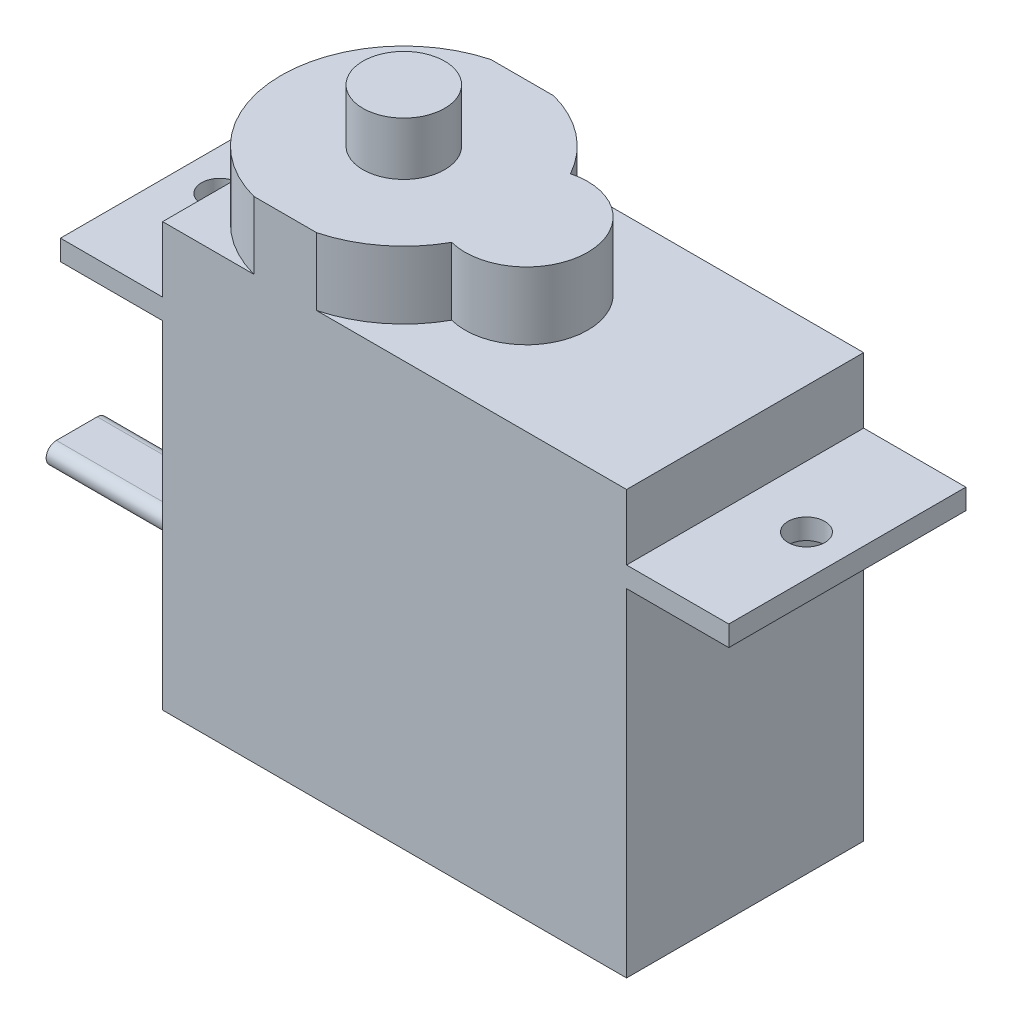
ISO-10303-21;
HEADER;
FILE_DESCRIPTION(('STEP AP214'),'2;1');
FILE_NAME('part.step','',(''),(''),'','','');
FILE_SCHEMA(('AUTOMOTIVE_DESIGN { 1 0 10303 214 1 1 1 1 }'));
ENDSEC;
DATA;
#1=APPLICATION_CONTEXT('core data for automotive mechanical design processes');
#2=APPLICATION_PROTOCOL_DEFINITION('international standard','automotive_design',2000,#1);
#3=PRODUCT_CONTEXT('',#1,'mechanical');
#4=PRODUCT('Part','Part','',(#3));
#5=PRODUCT_RELATED_PRODUCT_CATEGORY('part','',(#4));
#6=PRODUCT_DEFINITION_FORMATION('','',#4);
#7=PRODUCT_DEFINITION_CONTEXT('part definition',#1,'design');
#8=PRODUCT_DEFINITION('design','',#6,#7);
#9=PRODUCT_DEFINITION_SHAPE('','',#8);
#10=(LENGTH_UNIT() NAMED_UNIT(*) SI_UNIT(.MILLI.,.METRE.));
#11=(NAMED_UNIT(*) PLANE_ANGLE_UNIT() SI_UNIT($,.RADIAN.));
#12=(NAMED_UNIT(*) SI_UNIT($,.STERADIAN.) SOLID_ANGLE_UNIT());
#13=UNCERTAINTY_MEASURE_WITH_UNIT(LENGTH_MEASURE(1.E-05),#10,'distance_accuracy_value','');
#14=(GEOMETRIC_REPRESENTATION_CONTEXT(3) GLOBAL_UNCERTAINTY_ASSIGNED_CONTEXT((#13)) GLOBAL_UNIT_ASSIGNED_CONTEXT((#10,
#11,#12)) REPRESENTATION_CONTEXT('',''));
#15=CARTESIAN_POINT('',(0.,0.,0.));
#16=DIRECTION('',(0.,0.,1.));
#17=DIRECTION('',(1.,0.,0.));
#18=AXIS2_PLACEMENT_3D('',#15,#16,#17);
#19=CARTESIAN_POINT('',(0.,0.,11.6));
#20=DIRECTION('',(1.,0.,0.));
#21=DIRECTION('',(0.,0.,-1.));
#22=AXIS2_PLACEMENT_3D('',#19,#20,#21);
#23=PLANE('',#22);
#24=DIRECTION('',(0.,-1.,0.));
#25=VECTOR('',#24,1.);
#26=CARTESIAN_POINT('',(0.,0.,0.));
#27=LINE('',#26,#25);
#28=CARTESIAN_POINT('',(0.,16.5,0.));
#29=VERTEX_POINT('',#28);
#30=CARTESIAN_POINT('',(0.,0.,0.));
#31=VERTEX_POINT('',#30);
#32=EDGE_CURVE('E275',#29,#31,#27,.T.);
#33=ORIENTED_EDGE('',*,*,#32,.T.);
#34=DIRECTION('',(0.,0.,-1.));
#35=VECTOR('',#34,1.);
#36=CARTESIAN_POINT('',(0.,0.,11.6));
#37=LINE('',#36,#35);
#38=CARTESIAN_POINT('',(0.,0.,11.6));
#39=VERTEX_POINT('',#38);
#40=EDGE_CURVE('E42',#39,#31,#37,.T.);
#41=ORIENTED_EDGE('',*,*,#40,.F.);
#42=DIRECTION('',(0.,-1.,0.));
#43=VECTOR('',#42,1.);
#44=CARTESIAN_POINT('',(0.,0.,11.6));
#45=LINE('',#44,#43);
#46=CARTESIAN_POINT('',(0.,16.5,11.6));
#47=VERTEX_POINT('',#46);
#48=EDGE_CURVE('E276',#47,#39,#45,.T.);
#49=ORIENTED_EDGE('',*,*,#48,.F.);
#50=DIRECTION('',(0.,0.,-1.));
#51=VECTOR('',#50,1.);
#52=CARTESIAN_POINT('',(0.,16.5,11.6));
#53=LINE('',#52,#51);
#54=EDGE_CURVE('E321',#47,#29,#53,.T.);
#55=ORIENTED_EDGE('',*,*,#54,.T.);
#56=EDGE_LOOP('',(#33,#41,#49,#55));
#57=FACE_BOUND('',#56,.T.);
#58=CARTESIAN_POINT('',(0.,3.52962535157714,4.8));
#59=DIRECTION('',(-1.,0.,0.));
#60=DIRECTION('',(0.,0.,-1.));
#61=AXIS2_PLACEMENT_3D('',#58,#59,#60);
#62=CIRCLE('',#61,0.499999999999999);
#63=CARTESIAN_POINT('',(0.,4.02962535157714,4.8));
#64=VERTEX_POINT('',#63);
#65=CARTESIAN_POINT('',(0.,3.02962535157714,4.8));
#66=VERTEX_POINT('',#65);
#67=EDGE_CURVE('E207',#64,#66,#62,.T.);
#68=ORIENTED_EDGE('',*,*,#67,.F.);
#69=DIRECTION('',(0.,0.,-1.));
#70=VECTOR('',#69,1.);
#71=CARTESIAN_POINT('',(0.,4.02962535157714,4.8));
#72=LINE('',#71,#70);
#73=CARTESIAN_POINT('',(0.,4.02962535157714,6.8));
#74=VERTEX_POINT('',#73);
#75=EDGE_CURVE('E204',#74,#64,#72,.T.);
#76=ORIENTED_EDGE('',*,*,#75,.F.);
#77=CARTESIAN_POINT('',(0.,3.52962535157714,6.8));
#78=DIRECTION('',(-1.,0.,0.));
#79=DIRECTION('',(0.,0.,-1.));
#80=AXIS2_PLACEMENT_3D('',#77,#78,#79);
#81=CIRCLE('',#80,0.5);
#82=CARTESIAN_POINT('',(0.,3.02962535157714,6.8));
#83=VERTEX_POINT('',#82);
#84=EDGE_CURVE('E55',#83,#74,#81,.T.);
#85=ORIENTED_EDGE('',*,*,#84,.F.);
#86=DIRECTION('',(0.,0.,1.));
#87=VECTOR('',#86,1.);
#88=CARTESIAN_POINT('',(0.,3.02962535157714,6.8));
#89=LINE('',#88,#87);
#90=EDGE_CURVE('E50',#66,#83,#89,.T.);
#91=ORIENTED_EDGE('',*,*,#90,.F.);
#92=EDGE_LOOP('',(#68,#76,#85,#91));
#93=FACE_BOUND('',#92,.T.);
#94=ADVANCED_FACE('F34',(#57,#93),#23,.F.);
#95=CARTESIAN_POINT('',(6.,24.,5.8));
#96=DIRECTION('',(0.,1.,0.));
#97=DIRECTION('',(0.,0.,1.));
#98=AXIS2_PLACEMENT_3D('',#95,#96,#97);
#99=PLANE('',#98);
#100=CARTESIAN_POINT('',(6.,24.,5.8));
#101=DIRECTION('',(0.,1.,0.));
#102=DIRECTION('',(0.,0.,1.));
#103=AXIS2_PLACEMENT_3D('',#100,#101,#102);
#104=CIRCLE('',#103,6.);
#105=CARTESIAN_POINT('',(4.46377085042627,24.,0.));
#106=VERTEX_POINT('',#105);
#107=CARTESIAN_POINT('',(4.46377085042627,24.,11.6));
#108=VERTEX_POINT('',#107);
#109=EDGE_CURVE('E220',#106,#108,#104,.T.);
#110=ORIENTED_EDGE('',*,*,#109,.T.);
#111=DIRECTION('',(1.,0.,0.));
#112=VECTOR('',#111,1.);
#113=CARTESIAN_POINT('',(7.53622914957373,24.,11.6));
#114=LINE('',#113,#112);
#115=CARTESIAN_POINT('',(7.53622914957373,24.,11.6));
#116=VERTEX_POINT('',#115);
#117=EDGE_CURVE('E223',#108,#116,#114,.T.);
#118=ORIENTED_EDGE('',*,*,#117,.T.);
#119=CARTESIAN_POINT('',(6.,24.,5.8));
#120=DIRECTION('',(0.,1.,0.));
#121=DIRECTION('',(0.,0.,1.));
#122=AXIS2_PLACEMENT_3D('',#119,#120,#121);
#123=CIRCLE('',#122,6.);
#124=CARTESIAN_POINT('',(11.25,24.,8.70473750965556));
#125=VERTEX_POINT('',#124);
#126=EDGE_CURVE('E226',#116,#125,#123,.T.);
#127=ORIENTED_EDGE('',*,*,#126,.T.);
#128=CARTESIAN_POINT('',(12.,24.,5.8));
#129=DIRECTION('',(0.,1.,0.));
#130=DIRECTION('',(0.,0.,1.));
#131=AXIS2_PLACEMENT_3D('',#128,#129,#130);
#132=CIRCLE('',#131,3.);
#133=CARTESIAN_POINT('',(11.25,24.,2.89526249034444));
#134=VERTEX_POINT('',#133);
#135=EDGE_CURVE('E228',#125,#134,#132,.T.);
#136=ORIENTED_EDGE('',*,*,#135,.T.);
#137=CARTESIAN_POINT('',(6.,24.,5.8));
#138=DIRECTION('',(0.,1.,0.));
#139=DIRECTION('',(0.,0.,1.));
#140=AXIS2_PLACEMENT_3D('',#137,#138,#139);
#141=CIRCLE('',#140,6.);
#142=CARTESIAN_POINT('',(7.53622914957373,24.,0.));
#143=VERTEX_POINT('',#142);
#144=EDGE_CURVE('E230',#134,#143,#141,.T.);
#145=ORIENTED_EDGE('',*,*,#144,.T.);
#146=DIRECTION('',(-1.,0.,0.));
#147=VECTOR('',#146,1.);
#148=CARTESIAN_POINT('',(7.53622914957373,24.,0.));
#149=LINE('',#148,#147);
#150=EDGE_CURVE('E232',#143,#106,#149,.T.);
#151=ORIENTED_EDGE('',*,*,#150,.T.);
#152=EDGE_LOOP('',(#110,#118,#127,#136,#145,#151));
#153=FACE_BOUND('',#152,.T.);
#154=CARTESIAN_POINT('',(6.,24.,5.8));
#155=DIRECTION('',(0.,1.,0.));
#156=DIRECTION('',(0.,0.,1.));
#157=AXIS2_PLACEMENT_3D('',#154,#155,#156);
#158=CIRCLE('',#157,2.);
#159=CARTESIAN_POINT('',(6.,24.,7.8));
#160=VERTEX_POINT('',#159);
#161=EDGE_CURVE('E208',#160,#160,#158,.T.);
#162=ORIENTED_EDGE('',*,*,#161,.F.);
#163=EDGE_LOOP('',(#162));
#164=FACE_BOUND('',#163,.T.);
#165=ADVANCED_FACE('F380',(#153,#164),#99,.T.);
#166=CARTESIAN_POINT('',(0.,20.7,11.6));
#167=DIRECTION('',(0.,-1.,0.));
#168=DIRECTION('',(0.,0.,-1.));
#169=AXIS2_PLACEMENT_3D('',#166,#167,#168);
#170=PLANE('',#169);
#171=CARTESIAN_POINT('',(6.,20.7,5.8));
#172=DIRECTION('',(0.,1.,0.));
#173=DIRECTION('',(0.,0.,1.));
#174=AXIS2_PLACEMENT_3D('',#171,#172,#173);
#175=CIRCLE('',#174,6.);
#176=CARTESIAN_POINT('',(4.46377085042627,20.7,0.));
#177=VERTEX_POINT('',#176);
#178=CARTESIAN_POINT('',(0.,20.7,5.8));
#179=VERTEX_POINT('',#178);
#180=EDGE_CURVE('E218',#177,#179,#175,.T.);
#181=ORIENTED_EDGE('',*,*,#180,.F.);
#182=DIRECTION('',(-1.,0.,0.));
#183=VECTOR('',#182,1.);
#184=CARTESIAN_POINT('',(0.,20.7,0.));
#185=LINE('',#184,#183);
#186=CARTESIAN_POINT('',(0.,20.7,0.));
#187=VERTEX_POINT('',#186);
#188=EDGE_CURVE('E302',#177,#187,#185,.T.);
#189=ORIENTED_EDGE('',*,*,#188,.T.);
#190=DIRECTION('',(0.,0.,-1.));
#191=VECTOR('',#190,1.);
#192=CARTESIAN_POINT('',(0.,20.7,11.6));
#193=LINE('',#192,#191);
#194=EDGE_CURVE('E334',#179,#187,#193,.T.);
#195=ORIENTED_EDGE('',*,*,#194,.F.);
#196=EDGE_LOOP('',(#181,#189,#195));
#197=FACE_BOUND('',#196,.T.);
#198=ADVANCED_FACE('F385',(#197),#170,.F.);
#199=CARTESIAN_POINT('',(4.46377085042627,20.7,11.6));
#200=VERTEX_POINT('',#199);
#201=EDGE_CURVE('E11',#179,#200,#175,.T.);
#202=ORIENTED_EDGE('',*,*,#201,.F.);
#203=CARTESIAN_POINT('',(0.,20.7,11.6));
#204=VERTEX_POINT('',#203);
#205=EDGE_CURVE('E335',#204,#179,#193,.T.);
#206=ORIENTED_EDGE('',*,*,#205,.F.);
#207=DIRECTION('',(-1.,0.,0.));
#208=VECTOR('',#207,1.);
#209=CARTESIAN_POINT('',(0.,20.7,11.6));
#210=LINE('',#209,#208);
#211=EDGE_CURVE('E292',#200,#204,#210,.T.);
#212=ORIENTED_EDGE('',*,*,#211,.F.);
#213=EDGE_LOOP('',(#202,#206,#212));
#214=FACE_BOUND('',#213,.T.);
#215=ADVANCED_FACE('F464',(#214),#170,.F.);
#216=CARTESIAN_POINT('',(6.,20.7,5.8));
#217=DIRECTION('',(0.,1.,0.));
#218=DIRECTION('',(0.,0.,1.));
#219=AXIS2_PLACEMENT_3D('',#216,#217,#218);
#220=CIRCLE('',#219,6.);
#221=CARTESIAN_POINT('',(11.25,20.7,2.89526249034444));
#222=VERTEX_POINT('',#221);
#223=CARTESIAN_POINT('',(7.53622914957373,20.7,0.));
#224=VERTEX_POINT('',#223);
#225=EDGE_CURVE('E224',#222,#224,#220,.T.);
#226=ORIENTED_EDGE('',*,*,#225,.F.);
#227=CARTESIAN_POINT('',(12.,20.7,5.8));
#228=DIRECTION('',(0.,1.,0.));
#229=DIRECTION('',(0.,0.,1.));
#230=AXIS2_PLACEMENT_3D('',#227,#228,#229);
#231=CIRCLE('',#230,3.);
#232=CARTESIAN_POINT('',(11.25,20.7,8.70473750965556));
#233=VERTEX_POINT('',#232);
#234=EDGE_CURVE('E237',#233,#222,#231,.T.);
#235=ORIENTED_EDGE('',*,*,#234,.F.);
#236=CARTESIAN_POINT('',(6.,20.7,5.8));
#237=DIRECTION('',(0.,1.,0.));
#238=DIRECTION('',(0.,0.,1.));
#239=AXIS2_PLACEMENT_3D('',#236,#237,#238);
#240=CIRCLE('',#239,6.);
#241=CARTESIAN_POINT('',(7.53622914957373,20.7,11.6));
#242=VERTEX_POINT('',#241);
#243=EDGE_CURVE('E246',#242,#233,#240,.T.);
#244=ORIENTED_EDGE('',*,*,#243,.F.);
#245=CARTESIAN_POINT('',(22.7,20.7,11.6));
#246=VERTEX_POINT('',#245);
#247=EDGE_CURVE('E299',#246,#242,#210,.T.);
#248=ORIENTED_EDGE('',*,*,#247,.F.);
#249=DIRECTION('',(0.,0.,-1.));
#250=VECTOR('',#249,1.);
#251=CARTESIAN_POINT('',(22.7,20.7,11.6));
#252=LINE('',#251,#250);
#253=CARTESIAN_POINT('',(22.7,20.7,0.));
#254=VERTEX_POINT('',#253);
#255=EDGE_CURVE('E338',#246,#254,#252,.T.);
#256=ORIENTED_EDGE('',*,*,#255,.T.);
#257=EDGE_CURVE('E306',#254,#224,#185,.T.);
#258=ORIENTED_EDGE('',*,*,#257,.T.);
#259=EDGE_LOOP('',(#226,#235,#244,#248,#256,#258));
#260=FACE_BOUND('',#259,.T.);
#261=ADVANCED_FACE('F498',(#260),#170,.F.);
#262=CARTESIAN_POINT('',(0.,0.,11.6));
#263=DIRECTION('',(0.,1.,0.));
#264=DIRECTION('',(0.,0.,1.));
#265=AXIS2_PLACEMENT_3D('',#262,#263,#264);
#266=PLANE('',#265);
#267=DIRECTION('',(1.,0.,0.));
#268=VECTOR('',#267,1.);
#269=CARTESIAN_POINT('',(0.,0.,0.));
#270=LINE('',#269,#268);
#271=CARTESIAN_POINT('',(22.7,0.,0.));
#272=VERTEX_POINT('',#271);
#273=EDGE_CURVE('E480',#31,#272,#270,.T.);
#274=ORIENTED_EDGE('',*,*,#273,.T.);
#275=DIRECTION('',(0.,0.,-1.));
#276=VECTOR('',#275,1.);
#277=CARTESIAN_POINT('',(22.7,0.,11.6));
#278=LINE('',#277,#276);
#279=CARTESIAN_POINT('',(22.7,0.,11.6));
#280=VERTEX_POINT('',#279);
#281=EDGE_CURVE('E353',#280,#272,#278,.T.);
#282=ORIENTED_EDGE('',*,*,#281,.F.);
#283=DIRECTION('',(1.,0.,0.));
#284=VECTOR('',#283,1.);
#285=CARTESIAN_POINT('',(0.,0.,11.6));
#286=LINE('',#285,#284);
#287=EDGE_CURVE('E279',#39,#280,#286,.T.);
#288=ORIENTED_EDGE('',*,*,#287,.F.);
#289=ORIENTED_EDGE('',*,*,#40,.T.);
#290=EDGE_LOOP('',(#274,#282,#288,#289));
#291=FACE_BOUND('',#290,.T.);
#292=ADVANCED_FACE('F515',(#291),#266,.F.);
#293=CARTESIAN_POINT('',(22.7,0.,11.6));
#294=DIRECTION('',(-1.,0.,0.));
#295=DIRECTION('',(0.,0.,1.));
#296=AXIS2_PLACEMENT_3D('',#293,#294,#295);
#297=PLANE('',#296);
#298=DIRECTION('',(0.,1.,0.));
#299=VECTOR('',#298,1.);
#300=CARTESIAN_POINT('',(22.7,0.,0.));
#301=LINE('',#300,#299);
#302=CARTESIAN_POINT('',(22.7,16.5,0.));
#303=VERTEX_POINT('',#302);
#304=EDGE_CURVE('E482',#272,#303,#301,.T.);
#305=ORIENTED_EDGE('',*,*,#304,.T.);
#306=DIRECTION('',(0.,0.,-1.));
#307=VECTOR('',#306,1.);
#308=CARTESIAN_POINT('',(22.7,16.5,11.6));
#309=LINE('',#308,#307);
#310=CARTESIAN_POINT('',(22.7,16.5,11.6));
#311=VERTEX_POINT('',#310);
#312=EDGE_CURVE('E350',#311,#303,#309,.T.);
#313=ORIENTED_EDGE('',*,*,#312,.F.);
#314=DIRECTION('',(0.,1.,0.));
#315=VECTOR('',#314,1.);
#316=CARTESIAN_POINT('',(22.7,0.,11.6));
#317=LINE('',#316,#315);
#318=EDGE_CURVE('E282',#280,#311,#317,.T.);
#319=ORIENTED_EDGE('',*,*,#318,.F.);
#320=ORIENTED_EDGE('',*,*,#281,.T.);
#321=EDGE_LOOP('',(#305,#313,#319,#320));
#322=FACE_BOUND('',#321,.T.);
#323=ADVANCED_FACE('F522',(#322),#297,.F.);
#324=CARTESIAN_POINT('',(22.7,16.5,11.6));
#325=DIRECTION('',(0.,1.,0.));
#326=DIRECTION('',(0.,0.,1.));
#327=AXIS2_PLACEMENT_3D('',#324,#325,#326);
#328=PLANE('',#327);
#329=CARTESIAN_POINT('',(25.7,16.5,5.8));
#330=DIRECTION('',(0.,1.,0.));
#331=DIRECTION('',(0.,0.,1.));
#332=AXIS2_PLACEMENT_3D('',#329,#330,#331);
#333=CIRCLE('',#332,0.9);
#334=CARTESIAN_POINT('',(25.7,16.5,6.7));
#335=VERTEX_POINT('',#334);
#336=EDGE_CURVE('E272',#335,#335,#333,.T.);
#337=ORIENTED_EDGE('',*,*,#336,.T.);
#338=EDGE_LOOP('',(#337));
#339=FACE_BOUND('',#338,.T.);
#340=DIRECTION('',(1.,0.,0.));
#341=VECTOR('',#340,1.);
#342=CARTESIAN_POINT('',(22.7,16.5,0.));
#343=LINE('',#342,#341);
#344=CARTESIAN_POINT('',(27.7,16.5,0.));
#345=VERTEX_POINT('',#344);
#346=EDGE_CURVE('E484',#303,#345,#343,.T.);
#347=ORIENTED_EDGE('',*,*,#346,.T.);
#348=DIRECTION('',(0.,0.,-1.));
#349=VECTOR('',#348,1.);
#350=CARTESIAN_POINT('',(27.7,16.5,11.6));
#351=LINE('',#350,#349);
#352=CARTESIAN_POINT('',(27.7,16.5,11.6));
#353=VERTEX_POINT('',#352);
#354=EDGE_CURVE('E347',#353,#345,#351,.T.);
#355=ORIENTED_EDGE('',*,*,#354,.F.);
#356=DIRECTION('',(1.,0.,0.));
#357=VECTOR('',#356,1.);
#358=CARTESIAN_POINT('',(22.7,16.5,11.6));
#359=LINE('',#358,#357);
#360=EDGE_CURVE('E284',#311,#353,#359,.T.);
#361=ORIENTED_EDGE('',*,*,#360,.F.);
#362=ORIENTED_EDGE('',*,*,#312,.T.);
#363=EDGE_LOOP('',(#347,#355,#361,#362));
#364=FACE_BOUND('',#363,.T.);
#365=ADVANCED_FACE('F526',(#339,#364),#328,.F.);
#366=CARTESIAN_POINT('',(27.7,16.5,11.6));
#367=DIRECTION('',(-1.,0.,0.));
#368=DIRECTION('',(0.,0.,1.));
#369=AXIS2_PLACEMENT_3D('',#366,#367,#368);
#370=PLANE('',#369);
#371=DIRECTION('',(0.,1.,0.));
#372=VECTOR('',#371,1.);
#373=CARTESIAN_POINT('',(27.7,16.5,0.));
#374=LINE('',#373,#372);
#375=CARTESIAN_POINT('',(27.7,17.5,0.));
#376=VERTEX_POINT('',#375);
#377=EDGE_CURVE('E486',#345,#376,#374,.T.);
#378=ORIENTED_EDGE('',*,*,#377,.T.);
#379=DIRECTION('',(0.,0.,-1.));
#380=VECTOR('',#379,1.);
#381=CARTESIAN_POINT('',(27.7,17.5,11.6));
#382=LINE('',#381,#380);
#383=CARTESIAN_POINT('',(27.7,17.5,11.6));
#384=VERTEX_POINT('',#383);
#385=EDGE_CURVE('E344',#384,#376,#382,.T.);
#386=ORIENTED_EDGE('',*,*,#385,.F.);
#387=DIRECTION('',(0.,1.,0.));
#388=VECTOR('',#387,1.);
#389=CARTESIAN_POINT('',(27.7,16.5,11.6));
#390=LINE('',#389,#388);
#391=EDGE_CURVE('E286',#353,#384,#390,.T.);
#392=ORIENTED_EDGE('',*,*,#391,.F.);
#393=ORIENTED_EDGE('',*,*,#354,.T.);
#394=EDGE_LOOP('',(#378,#386,#392,#393));
#395=FACE_BOUND('',#394,.T.);
#396=ADVANCED_FACE('F531',(#395),#370,.F.);
#397=CARTESIAN_POINT('',(27.7,17.5,11.6));
#398=DIRECTION('',(0.,-1.,0.));
#399=DIRECTION('',(1.,0.,0.));
#400=AXIS2_PLACEMENT_3D('',#397,#398,#399);
#401=PLANE('',#400);
#402=CARTESIAN_POINT('',(25.7,17.5,5.8));
#403=DIRECTION('',(0.,1.,0.));
#404=DIRECTION('',(0.,0.,1.));
#405=AXIS2_PLACEMENT_3D('',#402,#403,#404);
#406=CIRCLE('',#405,0.9);
#407=CARTESIAN_POINT('',(25.7,17.5,6.7));
#408=VERTEX_POINT('',#407);
#409=EDGE_CURVE('E269',#408,#408,#406,.T.);
#410=ORIENTED_EDGE('',*,*,#409,.F.);
#411=EDGE_LOOP('',(#410));
#412=FACE_BOUND('',#411,.T.);
#413=DIRECTION('',(-1.,0.,0.));
#414=VECTOR('',#413,1.);
#415=CARTESIAN_POINT('',(27.7,17.5,0.));
#416=LINE('',#415,#414);
#417=CARTESIAN_POINT('',(22.7,17.5,0.));
#418=VERTEX_POINT('',#417);
#419=EDGE_CURVE('E487',#376,#418,#416,.T.);
#420=ORIENTED_EDGE('',*,*,#419,.T.);
#421=DIRECTION('',(0.,0.,-1.));
#422=VECTOR('',#421,1.);
#423=CARTESIAN_POINT('',(22.7,17.5,11.6));
#424=LINE('',#423,#422);
#425=CARTESIAN_POINT('',(22.7,17.5,11.6));
#426=VERTEX_POINT('',#425);
#427=EDGE_CURVE('E341',#426,#418,#424,.T.);
#428=ORIENTED_EDGE('',*,*,#427,.F.);
#429=DIRECTION('',(-1.,0.,0.));
#430=VECTOR('',#429,1.);
#431=CARTESIAN_POINT('',(27.7,17.5,11.6));
#432=LINE('',#431,#430);
#433=EDGE_CURVE('E288',#384,#426,#432,.T.);
#434=ORIENTED_EDGE('',*,*,#433,.F.);
#435=ORIENTED_EDGE('',*,*,#385,.T.);
#436=EDGE_LOOP('',(#420,#428,#434,#435));
#437=FACE_BOUND('',#436,.T.);
#438=ADVANCED_FACE('F533',(#412,#437),#401,.F.);
#439=CARTESIAN_POINT('',(22.7,17.5,11.6));
#440=DIRECTION('',(-1.,0.,0.));
#441=DIRECTION('',(0.,0.,1.));
#442=AXIS2_PLACEMENT_3D('',#439,#440,#441);
#443=PLANE('',#442);
#444=DIRECTION('',(0.,1.,0.));
#445=VECTOR('',#444,1.);
#446=CARTESIAN_POINT('',(22.7,17.5,0.));
#447=LINE('',#446,#445);
#448=EDGE_CURVE('E307',#418,#254,#447,.T.);
#449=ORIENTED_EDGE('',*,*,#448,.T.);
#450=ORIENTED_EDGE('',*,*,#255,.F.);
#451=DIRECTION('',(0.,1.,0.));
#452=VECTOR('',#451,1.);
#453=CARTESIAN_POINT('',(22.7,17.5,11.6));
#454=LINE('',#453,#452);
#455=EDGE_CURVE('E290',#426,#246,#454,.T.);
#456=ORIENTED_EDGE('',*,*,#455,.F.);
#457=ORIENTED_EDGE('',*,*,#427,.T.);
#458=EDGE_LOOP('',(#449,#450,#456,#457));
#459=FACE_BOUND('',#458,.T.);
#460=ADVANCED_FACE('F494',(#459),#443,.F.);
#461=CARTESIAN_POINT('',(0.,17.5,11.6));
#462=DIRECTION('',(1.,0.,0.));
#463=DIRECTION('',(0.,1.,0.));
#464=AXIS2_PLACEMENT_3D('',#461,#462,#463);
#465=PLANE('',#464);
#466=DIRECTION('',(0.,-1.,0.));
#467=VECTOR('',#466,1.);
#468=CARTESIAN_POINT('',(0.,17.5,0.));
#469=LINE('',#468,#467);
#470=CARTESIAN_POINT('',(0.,17.5,0.));
#471=VERTEX_POINT('',#470);
#472=EDGE_CURVE('E313',#187,#471,#469,.T.);
#473=ORIENTED_EDGE('',*,*,#472,.T.);
#474=DIRECTION('',(0.,0.,-1.));
#475=VECTOR('',#474,1.);
#476=CARTESIAN_POINT('',(0.,17.5,11.6));
#477=LINE('',#476,#475);
#478=CARTESIAN_POINT('',(0.,17.5,11.6));
#479=VERTEX_POINT('',#478);
#480=EDGE_CURVE('E331',#479,#471,#477,.T.);
#481=ORIENTED_EDGE('',*,*,#480,.F.);
#482=DIRECTION('',(0.,-1.,0.));
#483=VECTOR('',#482,1.);
#484=CARTESIAN_POINT('',(0.,17.5,11.6));
#485=LINE('',#484,#483);
#486=EDGE_CURVE('E295',#204,#479,#485,.T.);
#487=ORIENTED_EDGE('',*,*,#486,.F.);
#488=ORIENTED_EDGE('',*,*,#205,.T.);
#489=ORIENTED_EDGE('',*,*,#194,.T.);
#490=EDGE_LOOP('',(#473,#481,#487,#488,#489));
#491=FACE_BOUND('',#490,.T.);
#492=ADVANCED_FACE('F470',(#491),#465,.F.);
#493=CARTESIAN_POINT('',(0.,17.5,11.6));
#494=DIRECTION('',(0.,-1.,0.));
#495=DIRECTION('',(0.,0.,-1.));
#496=AXIS2_PLACEMENT_3D('',#493,#494,#495);
#497=PLANE('',#496);
#498=CARTESIAN_POINT('',(-3.,17.5,5.8));
#499=DIRECTION('',(0.,1.,0.));
#500=DIRECTION('',(0.,0.,1.));
#501=AXIS2_PLACEMENT_3D('',#498,#499,#500);
#502=CIRCLE('',#501,0.9);
#503=CARTESIAN_POINT('',(-3.,17.5,6.7));
#504=VERTEX_POINT('',#503);
#505=EDGE_CURVE('E264',#504,#504,#502,.T.);
#506=ORIENTED_EDGE('',*,*,#505,.F.);
#507=EDGE_LOOP('',(#506));
#508=FACE_BOUND('',#507,.T.);
#509=DIRECTION('',(-1.,0.,0.));
#510=VECTOR('',#509,1.);
#511=CARTESIAN_POINT('',(0.,17.5,0.));
#512=LINE('',#511,#510);
#513=CARTESIAN_POINT('',(-5.,17.5,0.));
#514=VERTEX_POINT('',#513);
#515=EDGE_CURVE('E316',#471,#514,#512,.T.);
#516=ORIENTED_EDGE('',*,*,#515,.T.);
#517=DIRECTION('',(0.,0.,-1.));
#518=VECTOR('',#517,1.);
#519=CARTESIAN_POINT('',(-5.,17.5,11.6));
#520=LINE('',#519,#518);
#521=CARTESIAN_POINT('',(-5.,17.5,11.6));
#522=VERTEX_POINT('',#521);
#523=EDGE_CURVE('E328',#522,#514,#520,.T.);
#524=ORIENTED_EDGE('',*,*,#523,.F.);
#525=DIRECTION('',(-1.,0.,0.));
#526=VECTOR('',#525,1.);
#527=CARTESIAN_POINT('',(0.,17.5,11.6));
#528=LINE('',#527,#526);
#529=EDGE_CURVE('E473',#479,#522,#528,.T.);
#530=ORIENTED_EDGE('',*,*,#529,.F.);
#531=ORIENTED_EDGE('',*,*,#480,.T.);
#532=EDGE_LOOP('',(#516,#524,#530,#531));
#533=FACE_BOUND('',#532,.T.);
#534=ADVANCED_FACE('F505',(#508,#533),#497,.F.);
#535=CARTESIAN_POINT('',(-5.,16.5,11.6));
#536=DIRECTION('',(1.,0.,0.));
#537=DIRECTION('',(0.,1.,0.));
#538=AXIS2_PLACEMENT_3D('',#535,#536,#537);
#539=PLANE('',#538);
#540=DIRECTION('',(0.,-1.,0.));
#541=VECTOR('',#540,1.);
#542=CARTESIAN_POINT('',(-5.,16.5,0.));
#543=LINE('',#542,#541);
#544=CARTESIAN_POINT('',(-5.,16.5,0.));
#545=VERTEX_POINT('',#544);
#546=EDGE_CURVE('E318',#514,#545,#543,.T.);
#547=ORIENTED_EDGE('',*,*,#546,.T.);
#548=DIRECTION('',(0.,0.,-1.));
#549=VECTOR('',#548,1.);
#550=CARTESIAN_POINT('',(-5.,16.5,11.6));
#551=LINE('',#550,#549);
#552=CARTESIAN_POINT('',(-5.,16.5,11.6));
#553=VERTEX_POINT('',#552);
#554=EDGE_CURVE('E324',#553,#545,#551,.T.);
#555=ORIENTED_EDGE('',*,*,#554,.F.);
#556=DIRECTION('',(0.,-1.,0.));
#557=VECTOR('',#556,1.);
#558=CARTESIAN_POINT('',(-5.,16.5,11.6));
#559=LINE('',#558,#557);
#560=EDGE_CURVE('E474',#522,#553,#559,.T.);
#561=ORIENTED_EDGE('',*,*,#560,.F.);
#562=ORIENTED_EDGE('',*,*,#523,.T.);
#563=EDGE_LOOP('',(#547,#555,#561,#562));
#564=FACE_BOUND('',#563,.T.);
#565=ADVANCED_FACE('F509',(#564),#539,.F.);
#566=CARTESIAN_POINT('',(-5.,16.5,11.6));
#567=DIRECTION('',(0.,1.,0.));
#568=DIRECTION('',(0.,0.,1.));
#569=AXIS2_PLACEMENT_3D('',#566,#567,#568);
#570=PLANE('',#569);
#571=CARTESIAN_POINT('',(-3.,16.5,5.8));
#572=DIRECTION('',(0.,1.,0.));
#573=DIRECTION('',(0.,0.,1.));
#574=AXIS2_PLACEMENT_3D('',#571,#572,#573);
#575=CIRCLE('',#574,0.9);
#576=CARTESIAN_POINT('',(-3.,16.5,6.7));
#577=VERTEX_POINT('',#576);
#578=EDGE_CURVE('E267',#577,#577,#575,.T.);
#579=ORIENTED_EDGE('',*,*,#578,.T.);
#580=EDGE_LOOP('',(#579));
#581=FACE_BOUND('',#580,.T.);
#582=DIRECTION('',(1.,0.,0.));
#583=VECTOR('',#582,1.);
#584=CARTESIAN_POINT('',(-5.,16.5,0.));
#585=LINE('',#584,#583);
#586=EDGE_CURVE('E280',#545,#29,#585,.T.);
#587=ORIENTED_EDGE('',*,*,#586,.T.);
#588=ORIENTED_EDGE('',*,*,#54,.F.);
#589=DIRECTION('',(1.,0.,0.));
#590=VECTOR('',#589,1.);
#591=CARTESIAN_POINT('',(-5.,16.5,11.6));
#592=LINE('',#591,#590);
#593=EDGE_CURVE('E325',#553,#47,#592,.T.);
#594=ORIENTED_EDGE('',*,*,#593,.F.);
#595=ORIENTED_EDGE('',*,*,#554,.T.);
#596=EDGE_LOOP('',(#587,#588,#594,#595));
#597=FACE_BOUND('',#596,.T.);
#598=ADVANCED_FACE('F360',(#581,#597),#570,.F.);
#599=CARTESIAN_POINT('',(0.,16.5,11.6));
#600=DIRECTION('',(0.,0.,-1.));
#601=DIRECTION('',(-1.,0.,0.));
#602=AXIS2_PLACEMENT_3D('',#599,#600,#601);
#603=PLANE('',#602);
#604=ORIENTED_EDGE('',*,*,#48,.T.);
#605=ORIENTED_EDGE('',*,*,#287,.T.);
#606=ORIENTED_EDGE('',*,*,#318,.T.);
#607=ORIENTED_EDGE('',*,*,#360,.T.);
#608=ORIENTED_EDGE('',*,*,#391,.T.);
#609=ORIENTED_EDGE('',*,*,#433,.T.);
#610=ORIENTED_EDGE('',*,*,#455,.T.);
#611=ORIENTED_EDGE('',*,*,#247,.T.);
#612=DIRECTION('',(0.,-1.,0.));
#613=VECTOR('',#612,1.);
#614=CARTESIAN_POINT('',(7.53622914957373,24.,11.6));
#615=LINE('',#614,#613);
#616=EDGE_CURVE('E263',#116,#242,#615,.T.);
#617=ORIENTED_EDGE('',*,*,#616,.F.);
#618=ORIENTED_EDGE('',*,*,#117,.F.);
#619=DIRECTION('',(0.,-1.,0.));
#620=VECTOR('',#619,1.);
#621=CARTESIAN_POINT('',(4.46377085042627,24.,11.6));
#622=LINE('',#621,#620);
#623=EDGE_CURVE('E268',#108,#200,#622,.T.);
#624=ORIENTED_EDGE('',*,*,#623,.T.);
#625=ORIENTED_EDGE('',*,*,#211,.T.);
#626=ORIENTED_EDGE('',*,*,#486,.T.);
#627=ORIENTED_EDGE('',*,*,#529,.T.);
#628=ORIENTED_EDGE('',*,*,#560,.T.);
#629=ORIENTED_EDGE('',*,*,#593,.T.);
#630=EDGE_LOOP('',(#604,#605,#606,#607,#608,#609,#610,#611,#617,#618,#624,#625,#626,#627,#628,#629));
#631=FACE_BOUND('',#630,.T.);
#632=ADVANCED_FACE('F455',(#631),#603,.F.);
#633=CARTESIAN_POINT('',(0.,16.5,0.));
#634=DIRECTION('',(0.,0.,-1.));
#635=DIRECTION('',(-1.,0.,0.));
#636=AXIS2_PLACEMENT_3D('',#633,#634,#635);
#637=PLANE('',#636);
#638=ORIENTED_EDGE('',*,*,#32,.F.);
#639=ORIENTED_EDGE('',*,*,#586,.F.);
#640=ORIENTED_EDGE('',*,*,#546,.F.);
#641=ORIENTED_EDGE('',*,*,#515,.F.);
#642=ORIENTED_EDGE('',*,*,#472,.F.);
#643=ORIENTED_EDGE('',*,*,#188,.F.);
#644=DIRECTION('',(0.,-1.,0.));
#645=VECTOR('',#644,1.);
#646=CARTESIAN_POINT('',(4.46377085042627,24.,0.));
#647=LINE('',#646,#645);
#648=EDGE_CURVE('E234',#106,#177,#647,.T.);
#649=ORIENTED_EDGE('',*,*,#648,.F.);
#650=ORIENTED_EDGE('',*,*,#150,.F.);
#651=DIRECTION('',(0.,-1.,0.));
#652=VECTOR('',#651,1.);
#653=CARTESIAN_POINT('',(7.53622914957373,24.,0.));
#654=LINE('',#653,#652);
#655=EDGE_CURVE('E251',#143,#224,#654,.T.);
#656=ORIENTED_EDGE('',*,*,#655,.T.);
#657=ORIENTED_EDGE('',*,*,#257,.F.);
#658=ORIENTED_EDGE('',*,*,#448,.F.);
#659=ORIENTED_EDGE('',*,*,#419,.F.);
#660=ORIENTED_EDGE('',*,*,#377,.F.);
#661=ORIENTED_EDGE('',*,*,#346,.F.);
#662=ORIENTED_EDGE('',*,*,#304,.F.);
#663=ORIENTED_EDGE('',*,*,#273,.F.);
#664=EDGE_LOOP('',(#638,#639,#640,#641,#642,#643,#649,#650,#656,#657,#658,#659,#660,#661,#662,#663));
#665=FACE_BOUND('',#664,.T.);
#666=ADVANCED_FACE('F376',(#665),#637,.T.);
#667=CARTESIAN_POINT('',(25.7,0.,5.8));
#668=DIRECTION('',(0.,1.,0.));
#669=DIRECTION('',(0.,0.,1.));
#670=AXIS2_PLACEMENT_3D('',#667,#668,#669);
#671=CYLINDRICAL_SURFACE('',#670,0.9);
#672=ORIENTED_EDGE('',*,*,#409,.T.);
#673=EDGE_LOOP('',(#672));
#674=FACE_BOUND('',#673,.T.);
#675=ORIENTED_EDGE('',*,*,#336,.F.);
#676=EDGE_LOOP('',(#675));
#677=FACE_BOUND('',#676,.T.);
#678=ADVANCED_FACE('F366',(#674,#677),#671,.F.);
#679=CARTESIAN_POINT('',(-3.,0.,5.8));
#680=DIRECTION('',(0.,1.,0.));
#681=DIRECTION('',(0.,0.,1.));
#682=AXIS2_PLACEMENT_3D('',#679,#680,#681);
#683=CYLINDRICAL_SURFACE('',#682,0.9);
#684=ORIENTED_EDGE('',*,*,#505,.T.);
#685=EDGE_LOOP('',(#684));
#686=FACE_BOUND('',#685,.T.);
#687=ORIENTED_EDGE('',*,*,#578,.F.);
#688=EDGE_LOOP('',(#687));
#689=FACE_BOUND('',#688,.T.);
#690=ADVANCED_FACE('F363',(#686,#689),#683,.F.);
#691=CARTESIAN_POINT('',(6.,24.,5.8));
#692=DIRECTION('',(0.,-1.,0.));
#693=DIRECTION('',(0.,0.,-1.));
#694=AXIS2_PLACEMENT_3D('',#691,#692,#693);
#695=CYLINDRICAL_SURFACE('',#694,6.);
#696=ORIENTED_EDGE('',*,*,#180,.T.);
#697=ORIENTED_EDGE('',*,*,#201,.T.);
#698=ORIENTED_EDGE('',*,*,#623,.F.);
#699=ORIENTED_EDGE('',*,*,#109,.F.);
#700=ORIENTED_EDGE('',*,*,#648,.T.);
#701=EDGE_LOOP('',(#696,#697,#698,#699,#700));
#702=FACE_BOUND('',#701,.T.);
#703=ADVANCED_FACE('F365',(#702),#695,.T.);
#704=CARTESIAN_POINT('',(6.,24.,5.8));
#705=DIRECTION('',(0.,-1.,0.));
#706=DIRECTION('',(0.,0.,-1.));
#707=AXIS2_PLACEMENT_3D('',#704,#705,#706);
#708=CYLINDRICAL_SURFACE('',#707,6.);
#709=ORIENTED_EDGE('',*,*,#243,.T.);
#710=DIRECTION('',(0.,-1.,0.));
#711=VECTOR('',#710,1.);
#712=CARTESIAN_POINT('',(11.25,24.,8.70473750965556));
#713=LINE('',#712,#711);
#714=EDGE_CURVE('E260',#125,#233,#713,.T.);
#715=ORIENTED_EDGE('',*,*,#714,.F.);
#716=ORIENTED_EDGE('',*,*,#126,.F.);
#717=ORIENTED_EDGE('',*,*,#616,.T.);
#718=EDGE_LOOP('',(#709,#715,#716,#717));
#719=FACE_BOUND('',#718,.T.);
#720=ADVANCED_FACE('F373',(#719),#708,.T.);
#721=CARTESIAN_POINT('',(12.,24.,5.8));
#722=DIRECTION('',(0.,-1.,0.));
#723=DIRECTION('',(0.,0.,-1.));
#724=AXIS2_PLACEMENT_3D('',#721,#722,#723);
#725=CYLINDRICAL_SURFACE('',#724,3.);
#726=ORIENTED_EDGE('',*,*,#234,.T.);
#727=DIRECTION('',(0.,-1.,0.));
#728=VECTOR('',#727,1.);
#729=CARTESIAN_POINT('',(11.25,24.,2.89526249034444));
#730=LINE('',#729,#728);
#731=EDGE_CURVE('E257',#134,#222,#730,.T.);
#732=ORIENTED_EDGE('',*,*,#731,.F.);
#733=ORIENTED_EDGE('',*,*,#135,.F.);
#734=ORIENTED_EDGE('',*,*,#714,.T.);
#735=EDGE_LOOP('',(#726,#732,#733,#734));
#736=FACE_BOUND('',#735,.T.);
#737=ADVANCED_FACE('F429',(#736),#725,.T.);
#738=CARTESIAN_POINT('',(6.,24.,5.8));
#739=DIRECTION('',(0.,-1.,0.));
#740=DIRECTION('',(0.,0.,-1.));
#741=AXIS2_PLACEMENT_3D('',#738,#739,#740);
#742=CYLINDRICAL_SURFACE('',#741,6.);
#743=ORIENTED_EDGE('',*,*,#225,.T.);
#744=ORIENTED_EDGE('',*,*,#655,.F.);
#745=ORIENTED_EDGE('',*,*,#144,.F.);
#746=ORIENTED_EDGE('',*,*,#731,.T.);
#747=EDGE_LOOP('',(#743,#744,#745,#746));
#748=FACE_BOUND('',#747,.T.);
#749=ADVANCED_FACE('F424',(#748),#742,.T.);
#750=CARTESIAN_POINT('',(6.,26.6,5.8));
#751=DIRECTION('',(0.,-1.,0.));
#752=DIRECTION('',(0.,0.,-1.));
#753=AXIS2_PLACEMENT_3D('',#750,#751,#752);
#754=CYLINDRICAL_SURFACE('',#753,2.);
#755=CARTESIAN_POINT('',(6.,26.6,5.8));
#756=DIRECTION('',(0.,1.,0.));
#757=DIRECTION('',(0.,0.,1.));
#758=AXIS2_PLACEMENT_3D('',#755,#756,#757);
#759=CIRCLE('',#758,2.);
#760=CARTESIAN_POINT('',(6.,26.6,7.8));
#761=VERTEX_POINT('',#760);
#762=EDGE_CURVE('E211',#761,#761,#759,.T.);
#763=ORIENTED_EDGE('',*,*,#762,.F.);
#764=EDGE_LOOP('',(#763));
#765=FACE_BOUND('',#764,.T.);
#766=ORIENTED_EDGE('',*,*,#161,.T.);
#767=EDGE_LOOP('',(#766));
#768=FACE_BOUND('',#767,.T.);
#769=ADVANCED_FACE('F421',(#765,#768),#754,.T.);
#770=CARTESIAN_POINT('',(6.,26.6,5.8));
#771=DIRECTION('',(0.,1.,0.));
#772=DIRECTION('',(0.,0.,1.));
#773=AXIS2_PLACEMENT_3D('',#770,#771,#772);
#774=PLANE('',#773);
#775=ORIENTED_EDGE('',*,*,#762,.T.);
#776=EDGE_LOOP('',(#775));
#777=FACE_BOUND('',#776,.T.);
#778=ADVANCED_FACE('F418',(#777),#774,.T.);
#779=CARTESIAN_POINT('',(-10.,3.52962535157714,4.8));
#780=DIRECTION('',(1.,0.,0.));
#781=DIRECTION('',(0.,0.,-1.));
#782=AXIS2_PLACEMENT_3D('',#779,#780,#781);
#783=CYLINDRICAL_SURFACE('',#782,0.499999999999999);
#784=ORIENTED_EDGE('',*,*,#67,.T.);
#785=DIRECTION('',(1.,0.,0.));
#786=VECTOR('',#785,1.);
#787=CARTESIAN_POINT('',(-10.,3.02962535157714,4.8));
#788=LINE('',#787,#786);
#789=CARTESIAN_POINT('',(-10.,3.02962535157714,4.8));
#790=VERTEX_POINT('',#789);
#791=EDGE_CURVE('E188',#790,#66,#788,.T.);
#792=ORIENTED_EDGE('',*,*,#791,.F.);
#793=CARTESIAN_POINT('',(-10.,3.52962535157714,4.8));
#794=DIRECTION('',(-1.,0.,0.));
#795=DIRECTION('',(0.,0.,-1.));
#796=AXIS2_PLACEMENT_3D('',#793,#794,#795);
#797=CIRCLE('',#796,0.499999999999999);
#798=CARTESIAN_POINT('',(-10.,4.02962535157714,4.8));
#799=VERTEX_POINT('',#798);
#800=EDGE_CURVE('E195',#799,#790,#797,.T.);
#801=ORIENTED_EDGE('',*,*,#800,.F.);
#802=DIRECTION('',(1.,0.,0.));
#803=VECTOR('',#802,1.);
#804=CARTESIAN_POINT('',(-10.,4.02962535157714,4.8));
#805=LINE('',#804,#803);
#806=EDGE_CURVE('E396',#799,#64,#805,.T.);
#807=ORIENTED_EDGE('',*,*,#806,.T.);
#808=EDGE_LOOP('',(#784,#792,#801,#807));
#809=FACE_BOUND('',#808,.T.);
#810=ADVANCED_FACE('F206',(#809),#783,.T.);
#811=CARTESIAN_POINT('',(-10.,3.02962535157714,6.8));
#812=DIRECTION('',(0.,1.,0.));
#813=DIRECTION('',(0.,0.,1.));
#814=AXIS2_PLACEMENT_3D('',#811,#812,#813);
#815=PLANE('',#814);
#816=ORIENTED_EDGE('',*,*,#90,.T.);
#817=DIRECTION('',(1.,0.,0.));
#818=VECTOR('',#817,1.);
#819=CARTESIAN_POINT('',(-10.,3.02962535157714,6.8));
#820=LINE('',#819,#818);
#821=CARTESIAN_POINT('',(-10.,3.02962535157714,6.8));
#822=VERTEX_POINT('',#821);
#823=EDGE_CURVE('E191',#822,#83,#820,.T.);
#824=ORIENTED_EDGE('',*,*,#823,.F.);
#825=DIRECTION('',(0.,0.,1.));
#826=VECTOR('',#825,1.);
#827=CARTESIAN_POINT('',(-10.,3.02962535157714,6.8));
#828=LINE('',#827,#826);
#829=EDGE_CURVE('E184',#790,#822,#828,.T.);
#830=ORIENTED_EDGE('',*,*,#829,.F.);
#831=ORIENTED_EDGE('',*,*,#791,.T.);
#832=EDGE_LOOP('',(#816,#824,#830,#831));
#833=FACE_BOUND('',#832,.T.);
#834=ADVANCED_FACE('F186',(#833),#815,.F.);
#835=CARTESIAN_POINT('',(-10.,3.52962535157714,6.8));
#836=DIRECTION('',(1.,0.,0.));
#837=DIRECTION('',(0.,0.,-1.));
#838=AXIS2_PLACEMENT_3D('',#835,#836,#837);
#839=CYLINDRICAL_SURFACE('',#838,0.5);
#840=ORIENTED_EDGE('',*,*,#84,.T.);
#841=DIRECTION('',(1.,0.,0.));
#842=VECTOR('',#841,1.);
#843=CARTESIAN_POINT('',(-10.,4.02962535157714,6.8));
#844=LINE('',#843,#842);
#845=CARTESIAN_POINT('',(-10.,4.02962535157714,6.8));
#846=VERTEX_POINT('',#845);
#847=EDGE_CURVE('E213',#846,#74,#844,.T.);
#848=ORIENTED_EDGE('',*,*,#847,.F.);
#849=CARTESIAN_POINT('',(-10.,3.52962535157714,6.8));
#850=DIRECTION('',(-1.,0.,0.));
#851=DIRECTION('',(0.,0.,-1.));
#852=AXIS2_PLACEMENT_3D('',#849,#850,#851);
#853=CIRCLE('',#852,0.5);
#854=EDGE_CURVE('E194',#822,#846,#853,.T.);
#855=ORIENTED_EDGE('',*,*,#854,.F.);
#856=ORIENTED_EDGE('',*,*,#823,.T.);
#857=EDGE_LOOP('',(#840,#848,#855,#856));
#858=FACE_BOUND('',#857,.T.);
#859=ADVANCED_FACE('F405',(#858),#839,.T.);
#860=CARTESIAN_POINT('',(-10.,4.02962535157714,4.8));
#861=DIRECTION('',(0.,-1.,0.));
#862=DIRECTION('',(0.,0.,-1.));
#863=AXIS2_PLACEMENT_3D('',#860,#861,#862);
#864=PLANE('',#863);
#865=ORIENTED_EDGE('',*,*,#75,.T.);
#866=ORIENTED_EDGE('',*,*,#806,.F.);
#867=DIRECTION('',(0.,0.,-1.));
#868=VECTOR('',#867,1.);
#869=CARTESIAN_POINT('',(-10.,4.02962535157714,4.8));
#870=LINE('',#869,#868);
#871=EDGE_CURVE('E200',#846,#799,#870,.T.);
#872=ORIENTED_EDGE('',*,*,#871,.F.);
#873=ORIENTED_EDGE('',*,*,#847,.T.);
#874=EDGE_LOOP('',(#865,#866,#872,#873));
#875=FACE_BOUND('',#874,.T.);
#876=ADVANCED_FACE('F395',(#875),#864,.F.);
#877=CARTESIAN_POINT('',(-10.,3.52962535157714,4.8));
#878=DIRECTION('',(1.,0.,0.));
#879=DIRECTION('',(0.,0.,-1.));
#880=AXIS2_PLACEMENT_3D('',#877,#878,#879);
#881=PLANE('',#880);
#882=ORIENTED_EDGE('',*,*,#800,.T.);
#883=ORIENTED_EDGE('',*,*,#829,.T.);
#884=ORIENTED_EDGE('',*,*,#854,.T.);
#885=ORIENTED_EDGE('',*,*,#871,.T.);
#886=EDGE_LOOP('',(#882,#883,#884,#885));
#887=FACE_BOUND('',#886,.T.);
#888=ADVANCED_FACE('F198',(#887),#881,.F.);
#889=CLOSED_SHELL('',(#94,#165,#198,#215,#261,#292,#323,#365,#396,#438,#460,#492,#534,#565,#598,
#632,#666,#678,#690,#703,#720,#737,#749,#769,#778,#810,#834,#859,#876,#888));
#890=MANIFOLD_SOLID_BREP('B2',#889);
#891=ADVANCED_BREP_SHAPE_REPRESENTATION('',(#18,#890),#14);
#892=SHAPE_DEFINITION_REPRESENTATION(#9,#891);
ENDSEC;
END-ISO-10303-21;
